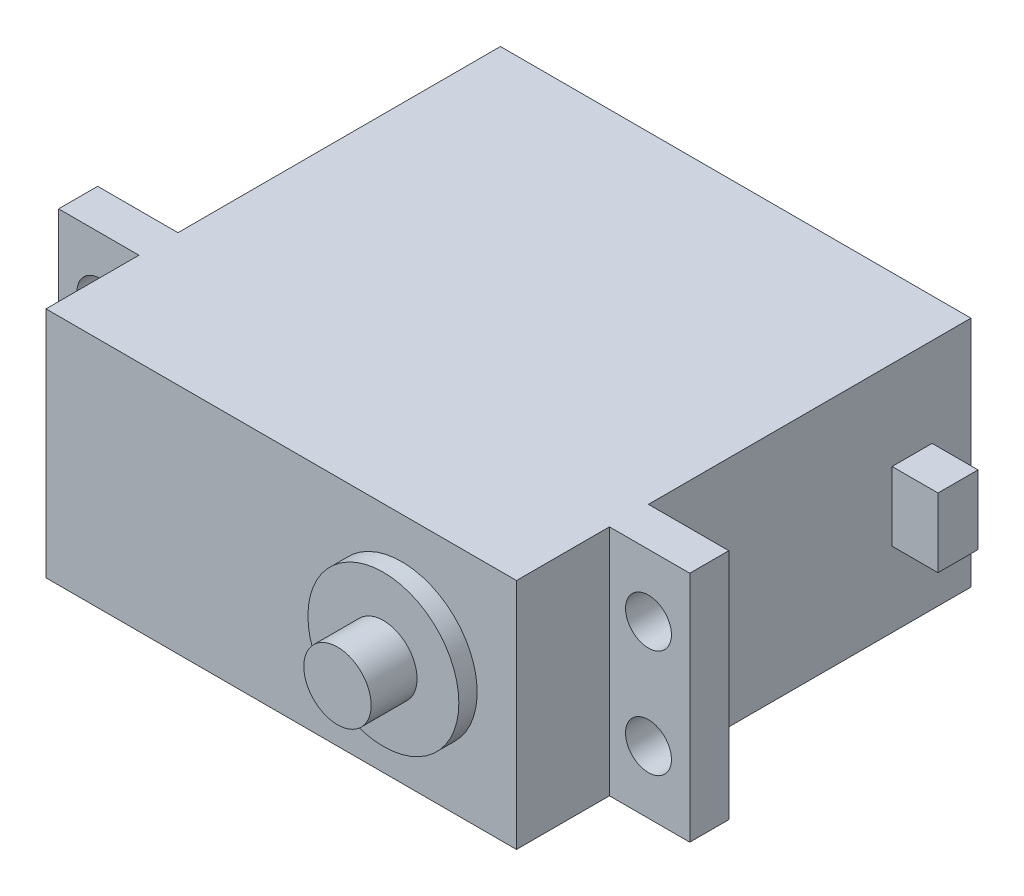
from build123d import *

# Parameters (mm, degrees)
SKETCH_1_W          = 41
SKETCH_1_H          = 39.6
SKETCH_1_W_2        = 7
SKETCH_1_H_2        = 3.4
EXTRUDE_1_DEPTH     = 20.3
EXTRUDE_2_DEPTH     = 1.6
SKETCH_3_R          = 2.935
EXTRUDE_3_DEPTH     = 4
SKETCH_4_R          = 2
CUT_EXTRUDE_1_DEPTH = 61.896141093
SKETCH_5_W          = 3.485581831
SKETCH_5_H          = 6.015439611
EXTRUDE_4_DEPTH     = 4


with BuildPart() as part:
    # Sketch 1 → Extrude 1 (new body)
    with BuildSketch(Plane(origin=(0, 0, 0), x_dir=(1, 0, 0), z_dir=(0, 1, 0))):
        with Locations((20.5, 19.8)):
            Rectangle(SKETCH_1_W, SKETCH_1_H)
        with Locations((-3.5, 9.8)):
            Rectangle(SKETCH_1_W_2, SKETCH_1_H_2)
        with Locations((44.5, 9.8)):
            Rectangle(SKETCH_1_W_2, SKETCH_1_H_2)
    extrude(amount=EXTRUDE_1_DEPTH)

    # Sketch 2 → Extrude 2 (add)
    with BuildSketch(Plane.XY):
        with BuildLine():
            ThreePointArc((24.425, 10.15), (31, 3.575), (37.575, 10.15))
            Line((37.575, 10.15), (24.425, 10.15))
        make_face()
        with BuildLine():
            Line((24.425, 10.15), (37.575, 10.15))
            ThreePointArc((37.575, 10.15), (31, 16.725), (24.425, 10.15))
        make_face()
        with BuildLine():
            ThreePointArc((24.425, 10.15), (31, 3.575), (37.575, 10.15))
            Line((37.575, 10.15), (24.425, 10.15))
        make_face()
        with BuildLine():
            Line((24.425, 10.15), (37.575, 10.15))
            ThreePointArc((37.575, 10.15), (31, 16.725), (24.425, 10.15))
        make_face()
    extrude(amount=EXTRUDE_2_DEPTH)

    # Sketch 3 → Extrude 3 (add)
    with BuildSketch(Plane.XY.offset(1.6)):
        with Locations((31, 10.15)):
            Circle(SKETCH_3_R)
    extrude(amount=EXTRUDE_3_DEPTH)

    # Sketch 4 → Cut-Extrude 1 (cut, through all)
    with BuildSketch(Plane.XY.offset(-8.1)):
        with Locations((-3.4, 14.85)):
            Circle(SKETCH_4_R)
        with Locations((-3.4, 5.45)):
            Circle(SKETCH_4_R)
        with Locations((44.4, 14.85)):
            Circle(SKETCH_4_R)
        with Locations((44.4, 5.45)):
            Circle(SKETCH_4_R)
    extrude(amount=-CUT_EXTRUDE_1_DEPTH, mode=Mode.SUBTRACT)

    # Sketch 5 → Extrude 4 (add)
    with BuildSketch(Plane(origin=(41, 0, 0), x_dir=(0, 0, -1), z_dir=(1, 0, 0))):
        with Locations((34.47410975, 9.531590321)):
            Rectangle(SKETCH_5_W, SKETCH_5_H)
    extrude(amount=EXTRUDE_4_DEPTH)


solid = part.part
